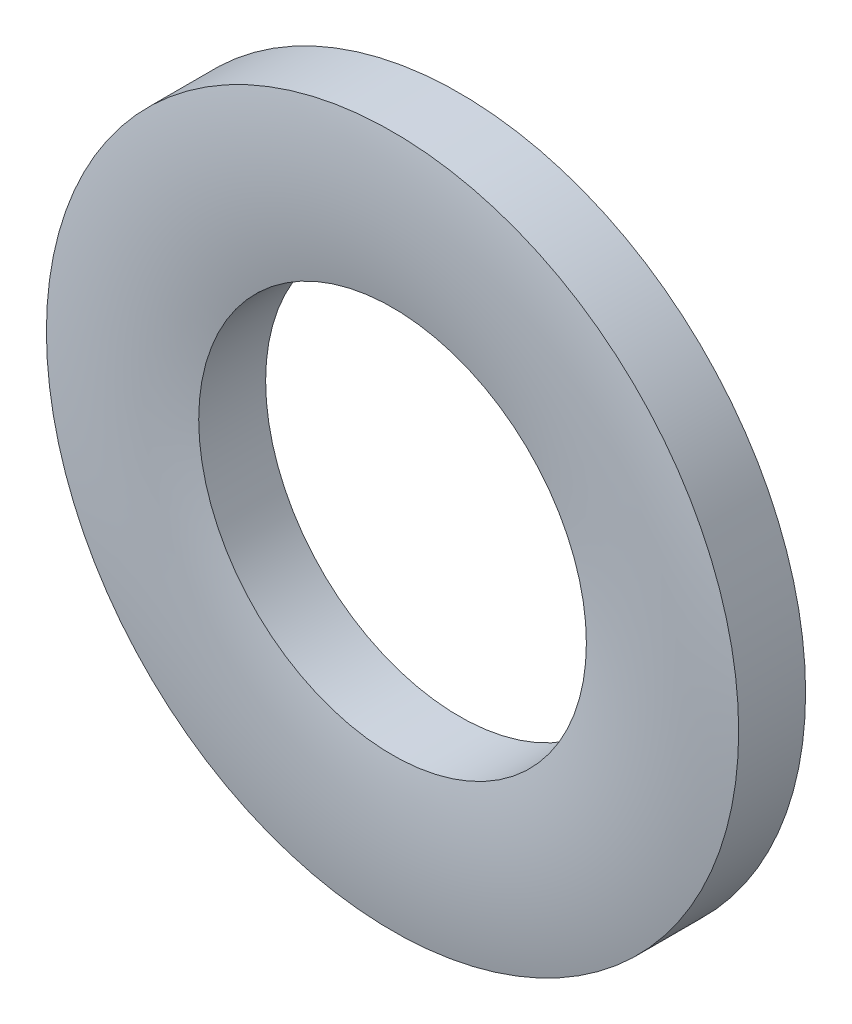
ISO-10303-21;
HEADER;
FILE_DESCRIPTION(('STEP AP214'),'2;1');
FILE_NAME('part.step','',(''),(''),'','','');
FILE_SCHEMA(('AUTOMOTIVE_DESIGN { 1 0 10303 214 1 1 1 1 }'));
ENDSEC;
DATA;
#1=APPLICATION_CONTEXT('core data for automotive mechanical design processes');
#2=APPLICATION_PROTOCOL_DEFINITION('international standard','automotive_design',2000,#1);
#3=PRODUCT_CONTEXT('',#1,'mechanical');
#4=PRODUCT('Part','Part','',(#3));
#5=PRODUCT_RELATED_PRODUCT_CATEGORY('part','',(#4));
#6=PRODUCT_DEFINITION_FORMATION('','',#4);
#7=PRODUCT_DEFINITION_CONTEXT('part definition',#1,'design');
#8=PRODUCT_DEFINITION('design','',#6,#7);
#9=PRODUCT_DEFINITION_SHAPE('','',#8);
#10=(LENGTH_UNIT() NAMED_UNIT(*) SI_UNIT(.MILLI.,.METRE.));
#11=(NAMED_UNIT(*) PLANE_ANGLE_UNIT() SI_UNIT($,.RADIAN.));
#12=(NAMED_UNIT(*) SI_UNIT($,.STERADIAN.) SOLID_ANGLE_UNIT());
#13=UNCERTAINTY_MEASURE_WITH_UNIT(LENGTH_MEASURE(1.E-05),#10,'distance_accuracy_value','');
#14=(GEOMETRIC_REPRESENTATION_CONTEXT(3) GLOBAL_UNCERTAINTY_ASSIGNED_CONTEXT((#13)) GLOBAL_UNIT_ASSIGNED_CONTEXT((#10,
#11,#12)) REPRESENTATION_CONTEXT('',''));
#15=CARTESIAN_POINT('',(0.,0.,0.));
#16=DIRECTION('',(0.,0.,1.));
#17=DIRECTION('',(1.,0.,0.));
#18=AXIS2_PLACEMENT_3D('',#15,#16,#17);
#19=CARTESIAN_POINT('',(0.,4.2,-0.799999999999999));
#20=DIRECTION('',(0.,0.,1.));
#21=DIRECTION('',(1.,0.,0.));
#22=AXIS2_PLACEMENT_3D('',#19,#20,#21);
#23=PLANE('',#22);
#24=CARTESIAN_POINT('',(0.,0.,-0.799999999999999));
#25=DIRECTION('',(0.,0.,1.));
#26=DIRECTION('',(1.,0.,0.));
#27=AXIS2_PLACEMENT_3D('',#24,#25,#26);
#28=CIRCLE('',#27,7.5);
#29=CARTESIAN_POINT('',(7.5,0.,-0.799999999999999));
#30=VERTEX_POINT('',#29);
#31=EDGE_CURVE('E51',#30,#30,#28,.T.);
#32=ORIENTED_EDGE('',*,*,#31,.F.);
#33=EDGE_LOOP('',(#32));
#34=FACE_BOUND('',#33,.T.);
#35=CARTESIAN_POINT('',(0.,0.,-0.799999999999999));
#36=DIRECTION('',(0.,0.,1.));
#37=DIRECTION('',(1.,0.,0.));
#38=AXIS2_PLACEMENT_3D('',#35,#36,#37);
#39=CIRCLE('',#38,4.2);
#40=CARTESIAN_POINT('',(4.2,0.,-0.799999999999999));
#41=VERTEX_POINT('',#40);
#42=EDGE_CURVE('E10',#41,#41,#39,.T.);
#43=ORIENTED_EDGE('',*,*,#42,.T.);
#44=EDGE_LOOP('',(#43));
#45=FACE_BOUND('',#44,.T.);
#46=ADVANCED_FACE('F37',(#34,#45),#23,.F.);
#47=CARTESIAN_POINT('',(0.,0.,0.8));
#48=DIRECTION('',(0.,0.,1.));
#49=DIRECTION('',(1.,0.,0.));
#50=AXIS2_PLACEMENT_3D('',#47,#48,#49);
#51=CYLINDRICAL_SURFACE('',#50,4.2);
#52=ORIENTED_EDGE('',*,*,#42,.F.);
#53=EDGE_LOOP('',(#52));
#54=FACE_BOUND('',#53,.T.);
#55=CARTESIAN_POINT('',(0.,0.,0.650079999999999));
#56=DIRECTION('',(0.,0.,1.));
#57=DIRECTION('',(1.,0.,0.));
#58=AXIS2_PLACEMENT_3D('',#55,#56,#57);
#59=CIRCLE('',#58,4.2);
#60=CARTESIAN_POINT('',(4.2,0.,0.650079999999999));
#61=VERTEX_POINT('',#60);
#62=EDGE_CURVE('E43',#61,#61,#59,.T.);
#63=ORIENTED_EDGE('',*,*,#62,.T.);
#64=EDGE_LOOP('',(#63));
#65=FACE_BOUND('',#64,.T.);
#66=ADVANCED_FACE('F60',(#54,#65),#51,.F.);
#67=CARTESIAN_POINT('',(0.,0.,-8.35480258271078));
#68=DIRECTION('',(0.,0.,1.));
#69=DIRECTION('',(1.,0.,0.));
#70=AXIS2_PLACEMENT_3D('',#67,#68,#69);
#71=DEGENERATE_TOROIDAL_SURFACE('',#70,5.85,9.15480258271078,.T.);
#72=ORIENTED_EDGE('',*,*,#62,.F.);
#73=EDGE_LOOP('',(#72));
#74=FACE_BOUND('',#73,.T.);
#75=CARTESIAN_POINT('',(0.,0.,0.650080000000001));
#76=DIRECTION('',(0.,0.,1.));
#77=DIRECTION('',(1.,0.,0.));
#78=AXIS2_PLACEMENT_3D('',#75,#76,#77);
#79=CIRCLE('',#78,7.5);
#80=CARTESIAN_POINT('',(7.5,0.,0.650080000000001));
#81=VERTEX_POINT('',#80);
#82=EDGE_CURVE('E47',#81,#81,#79,.T.);
#83=ORIENTED_EDGE('',*,*,#82,.T.);
#84=EDGE_LOOP('',(#83));
#85=FACE_BOUND('',#84,.T.);
#86=ADVANCED_FACE('F64',(#74,#85),#71,.T.);
#87=CARTESIAN_POINT('',(0.,0.,0.8));
#88=DIRECTION('',(0.,0.,1.));
#89=DIRECTION('',(1.,0.,0.));
#90=AXIS2_PLACEMENT_3D('',#87,#88,#89);
#91=CYLINDRICAL_SURFACE('',#90,7.5);
#92=ORIENTED_EDGE('',*,*,#82,.F.);
#93=EDGE_LOOP('',(#92));
#94=FACE_BOUND('',#93,.T.);
#95=ORIENTED_EDGE('',*,*,#31,.T.);
#96=EDGE_LOOP('',(#95));
#97=FACE_BOUND('',#96,.T.);
#98=ADVANCED_FACE('F57',(#94,#97),#91,.T.);
#99=CLOSED_SHELL('',(#46,#66,#86,#98));
#100=MANIFOLD_SOLID_BREP('B2',#99);
#101=ADVANCED_BREP_SHAPE_REPRESENTATION('',(#18,#100),#14);
#102=SHAPE_DEFINITION_REPRESENTATION(#9,#101);
ENDSEC;
END-ISO-10303-21;
